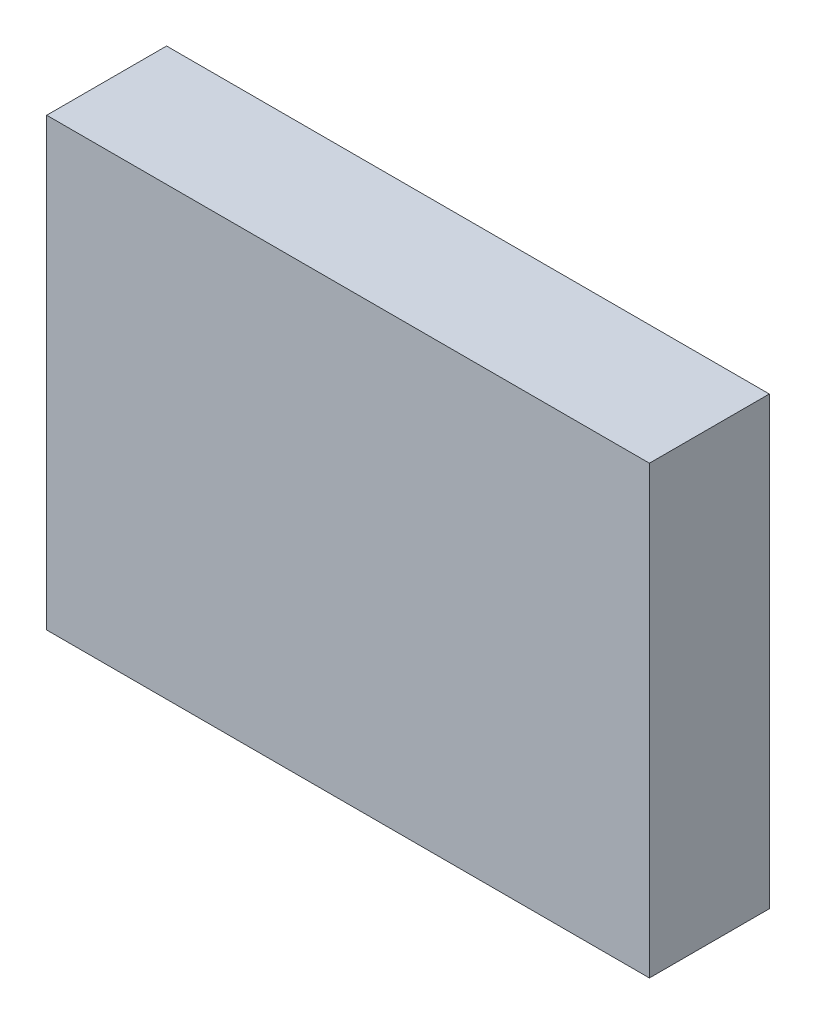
from build123d import *

# Parameters (mm, degrees)
ESQUISSE1_W      = 50.273365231
ESQUISSE1_H      = 37.188516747
EXTRUSION1_DEPTH = 10


with BuildPart() as part:
    # Esquisse1 → Extrusion1 (new body)
    with BuildSketch(Plane.XY):
        with Locations((12.740510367, 4.648564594)):
            Rectangle(ESQUISSE1_W, ESQUISSE1_H)
    extrude(amount=EXTRUSION1_DEPTH)


solid = part.part
